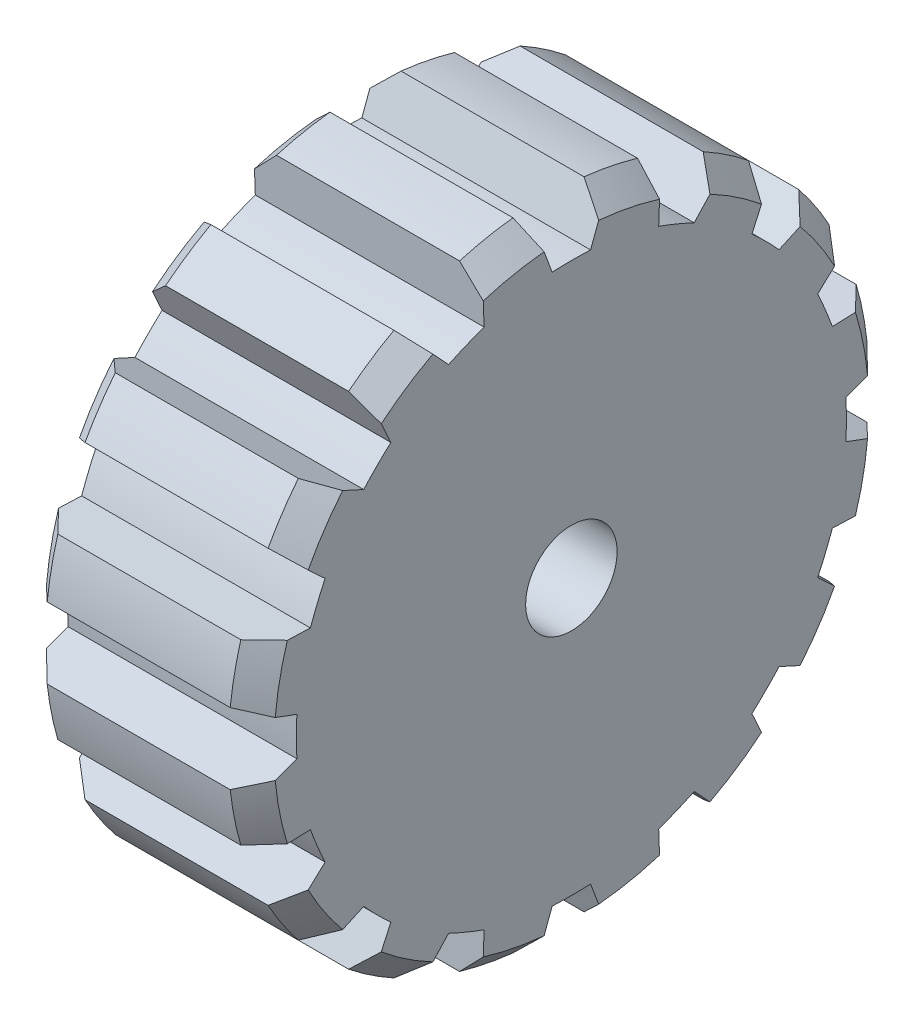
from build123d import *

# Parameters (mm, degrees)
CHAMFER4_SIZE      = 0.5
CUT_EXTRUDE1_DEPTH = 10


with BuildPart() as part:
    # Sketch1 → Revolve1 (revolve)
    with BuildSketch(Plane.XY):
        Polygon((0, 1), (-6, 1), (-6, 4), (-5, 4), (-5, 7), (0, 7), align=None)
    revolve(axis=Axis((0, 0, 0), (-1, 0, 0)))

    # Chamfer4
    chamfer4_edges = [part.edges().sort_by_distance(p)[0] for p in [
        (-6, -4, 0),
        (-5, -7, 0),
        (0, -7, 0),
    ]]
    chamfer(chamfer4_edges, length=CHAMFER4_SIZE)

    # Sketch3 → Cut-Extrude1 (cut)
    with BuildSketch(Plane(origin=(0, 0, 0), x_dir=(0, 0, -1), z_dir=(1, 0, 0))):
        with BuildLine():
            Line((-0.785, 6.978946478), (-0.42, 6))
            ThreePointArc((-0.42, 6), (0, 6.009805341), (0.42, 6))
            Line((0.42, 6), (0.785, 6.978946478))
            Line((0.785, 6.978946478), (0.785, 7.789228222))
            ThreePointArc((0.785, 7.789228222), (0, 7.81777382), (-0.785, 7.789228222))
            Line((-0.785, 7.789228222), (-0.785, 6.978946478))
        make_face()
        with BuildLine():
            Line((2.684129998, 5.382550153), (3.395972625, 6.147299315))
            Line((3.395972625, 6.147299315), (3.706054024, 6.895902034))
            ThreePointArc((3.706054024, 6.895902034), (2.991732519, 7.222681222), (2.255563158, 7.496715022))
            Line((2.255563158, 7.496715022), (1.945481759, 6.748112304))
            Line((1.945481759, 6.748112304), (1.908071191, 5.704004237))
            ThreePointArc((1.908071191, 5.704004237), (2.299852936, 5.552336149), (2.684129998, 5.382550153))
        make_face()
        with BuildLine():
            Line((4.539625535, 3.945655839), (5.489939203, 4.379781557))
            Line((5.489939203, 4.379781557), (6.062894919, 4.952737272))
            ThreePointArc((6.062894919, 4.952737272), (5.528000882, 5.528000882), (4.952737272, 6.062894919))
            Line((4.952737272, 6.062894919), (4.379781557, 5.489939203))
            Line((4.379781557, 5.489939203), (3.945655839, 4.539625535))
            ThreePointArc((3.945655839, 4.539625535), (4.24957411, 4.24957411), (4.539625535, 3.945655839))
        make_face()
        with BuildLine():
            Line((5.704004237, 1.908071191), (6.748112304, 1.945481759))
            Line((6.748112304, 1.945481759), (7.496715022, 2.255563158))
            ThreePointArc((7.496715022, 2.255563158), (7.222681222, 2.991732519), (6.895902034, 3.706054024))
            Line((6.895902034, 3.706054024), (6.147299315, 3.395972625))
            Line((6.147299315, 3.395972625), (5.382550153, 2.684129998))
            ThreePointArc((5.382550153, 2.684129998), (5.552336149, 2.299852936), (5.704004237, 1.908071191))
        make_face()
        with BuildLine():
            Line((6, -0.42), (6.978946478, -0.785))
            Line((6.978946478, -0.785), (7.789228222, -0.785))
            ThreePointArc((7.789228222, -0.785), (7.81777382, 0), (7.789228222, 0.785))
            Line((7.789228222, 0.785), (6.978946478, 0.785))
            Line((6.978946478, 0.785), (6, 0.42))
            ThreePointArc((6, 0.42), (6.009805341, 0), (6, -0.42))
        make_face()
        with BuildLine():
            Line((5.382550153, -2.684129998), (6.147299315, -3.395972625))
            Line((6.147299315, -3.395972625), (6.895902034, -3.706054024))
            ThreePointArc((6.895902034, -3.706054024), (7.222681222, -2.991732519), (7.496715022, -2.255563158))
            Line((7.496715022, -2.255563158), (6.748112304, -1.945481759))
            Line((6.748112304, -1.945481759), (5.704004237, -1.908071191))
            ThreePointArc((5.704004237, -1.908071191), (5.552336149, -2.299852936), (5.382550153, -2.684129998))
        make_face()
        with BuildLine():
            Line((3.945655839, -4.539625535), (4.379781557, -5.489939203))
            Line((4.379781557, -5.489939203), (4.952737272, -6.062894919))
            ThreePointArc((4.952737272, -6.062894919), (5.528000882, -5.528000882), (6.062894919, -4.952737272))
            Line((6.062894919, -4.952737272), (5.489939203, -4.379781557))
            Line((5.489939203, -4.379781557), (4.539625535, -3.945655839))
            ThreePointArc((4.539625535, -3.945655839), (4.24957411, -4.24957411), (3.945655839, -4.539625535))
        make_face()
        with BuildLine():
            Line((1.908071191, -5.704004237), (1.945481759, -6.748112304))
            Line((1.945481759, -6.748112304), (2.255563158, -7.496715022))
            ThreePointArc((2.255563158, -7.496715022), (2.991732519, -7.222681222), (3.706054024, -6.895902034))
            Line((3.706054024, -6.895902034), (3.395972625, -6.147299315))
            Line((3.395972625, -6.147299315), (2.684129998, -5.382550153))
            ThreePointArc((2.684129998, -5.382550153), (2.299852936, -5.552336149), (1.908071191, -5.704004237))
        make_face()
        with BuildLine():
            Line((-0.42, -6), (-0.785, -6.978946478))
            Line((-0.785, -6.978946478), (-0.785, -7.789228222))
            ThreePointArc((-0.785, -7.789228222), (0, -7.81777382), (0.785, -7.789228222))
            Line((0.785, -7.789228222), (0.785, -6.978946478))
            Line((0.785, -6.978946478), (0.42, -6))
            ThreePointArc((0.42, -6), (0, -6.009805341), (-0.42, -6))
        make_face()
        with BuildLine():
            Line((-2.684129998, -5.382550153), (-3.395972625, -6.147299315))
            Line((-3.395972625, -6.147299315), (-3.706054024, -6.895902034))
            ThreePointArc((-3.706054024, -6.895902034), (-2.991732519, -7.222681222), (-2.255563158, -7.496715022))
            Line((-2.255563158, -7.496715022), (-1.945481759, -6.748112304))
            Line((-1.945481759, -6.748112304), (-1.908071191, -5.704004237))
            ThreePointArc((-1.908071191, -5.704004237), (-2.299852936, -5.552336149), (-2.684129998, -5.382550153))
        make_face()
        with BuildLine():
            Line((-4.539625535, -3.945655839), (-5.489939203, -4.379781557))
            Line((-5.489939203, -4.379781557), (-6.062894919, -4.952737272))
            ThreePointArc((-6.062894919, -4.952737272), (-5.528000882, -5.528000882), (-4.952737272, -6.062894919))
            Line((-4.952737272, -6.062894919), (-4.379781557, -5.489939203))
            Line((-4.379781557, -5.489939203), (-3.945655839, -4.539625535))
            ThreePointArc((-3.945655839, -4.539625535), (-4.24957411, -4.24957411), (-4.539625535, -3.945655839))
        make_face()
        with BuildLine():
            Line((-5.704004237, -1.908071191), (-6.748112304, -1.945481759))
            Line((-6.748112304, -1.945481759), (-7.496715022, -2.255563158))
            ThreePointArc((-7.496715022, -2.255563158), (-7.222681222, -2.991732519), (-6.895902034, -3.706054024))
            Line((-6.895902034, -3.706054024), (-6.147299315, -3.395972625))
            Line((-6.147299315, -3.395972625), (-5.382550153, -2.684129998))
            ThreePointArc((-5.382550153, -2.684129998), (-5.552336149, -2.299852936), (-5.704004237, -1.908071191))
        make_face()
        with BuildLine():
            Line((-6, 0.42), (-6.978946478, 0.785))
            Line((-6.978946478, 0.785), (-7.789228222, 0.785))
            ThreePointArc((-7.789228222, 0.785), (-7.81777382, 0), (-7.789228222, -0.785))
            Line((-7.789228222, -0.785), (-6.978946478, -0.785))
            Line((-6.978946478, -0.785), (-6, -0.42))
            ThreePointArc((-6, -0.42), (-6.009805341, 0), (-6, 0.42))
        make_face()
        with BuildLine():
            Line((-5.382550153, 2.684129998), (-6.147299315, 3.395972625))
            Line((-6.147299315, 3.395972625), (-6.895902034, 3.706054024))
            ThreePointArc((-6.895902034, 3.706054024), (-7.222681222, 2.991732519), (-7.496715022, 2.255563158))
            Line((-7.496715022, 2.255563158), (-6.748112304, 1.945481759))
            Line((-6.748112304, 1.945481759), (-5.704004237, 1.908071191))
            ThreePointArc((-5.704004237, 1.908071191), (-5.552336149, 2.299852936), (-5.382550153, 2.684129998))
        make_face()
        with BuildLine():
            Line((-3.945655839, 4.539625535), (-4.379781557, 5.489939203))
            Line((-4.379781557, 5.489939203), (-4.952737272, 6.062894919))
            ThreePointArc((-4.952737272, 6.062894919), (-5.528000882, 5.528000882), (-6.062894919, 4.952737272))
            Line((-6.062894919, 4.952737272), (-5.489939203, 4.379781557))
            Line((-5.489939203, 4.379781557), (-4.539625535, 3.945655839))
            ThreePointArc((-4.539625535, 3.945655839), (-4.24957411, 4.24957411), (-3.945655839, 4.539625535))
        make_face()
        with BuildLine():
            Line((-1.908071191, 5.704004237), (-1.945481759, 6.748112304))
            Line((-1.945481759, 6.748112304), (-2.255563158, 7.496715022))
            ThreePointArc((-2.255563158, 7.496715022), (-2.991732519, 7.222681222), (-3.706054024, 6.895902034))
            Line((-3.706054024, 6.895902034), (-3.395972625, 6.147299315))
            Line((-3.395972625, 6.147299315), (-2.684129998, 5.382550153))
            ThreePointArc((-2.684129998, 5.382550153), (-2.299852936, 5.552336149), (-1.908071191, 5.704004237))
        make_face()
    extrude(amount=-CUT_EXTRUDE1_DEPTH, mode=Mode.SUBTRACT)


solid = part.part
